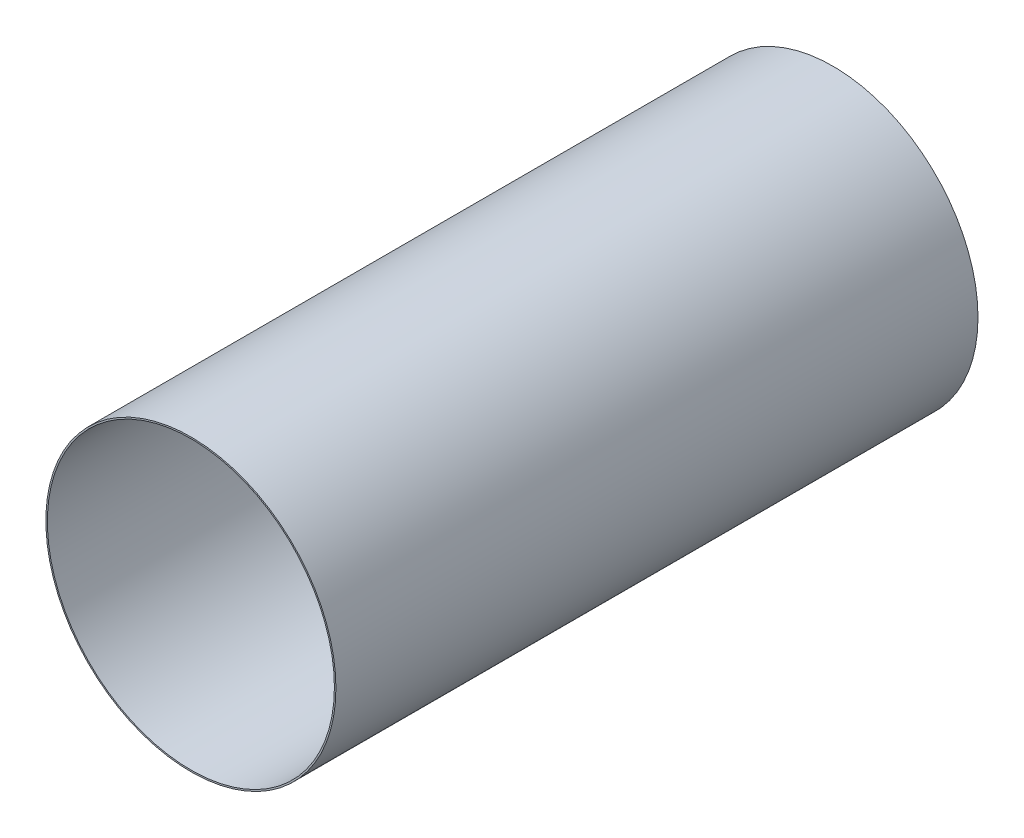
ISO-10303-21;
HEADER;
FILE_DESCRIPTION(('STEP AP214'),'2;1');
FILE_NAME('part.step','',(''),(''),'','','');
FILE_SCHEMA(('AUTOMOTIVE_DESIGN { 1 0 10303 214 1 1 1 1 }'));
ENDSEC;
DATA;
#1=APPLICATION_CONTEXT('core data for automotive mechanical design processes');
#2=APPLICATION_PROTOCOL_DEFINITION('international standard','automotive_design',2000,#1);
#3=PRODUCT_CONTEXT('',#1,'mechanical');
#4=PRODUCT('Part','Part','',(#3));
#5=PRODUCT_RELATED_PRODUCT_CATEGORY('part','',(#4));
#6=PRODUCT_DEFINITION_FORMATION('','',#4);
#7=PRODUCT_DEFINITION_CONTEXT('part definition',#1,'design');
#8=PRODUCT_DEFINITION('design','',#6,#7);
#9=PRODUCT_DEFINITION_SHAPE('','',#8);
#10=(LENGTH_UNIT() NAMED_UNIT(*) SI_UNIT(.MILLI.,.METRE.));
#11=(NAMED_UNIT(*) PLANE_ANGLE_UNIT() SI_UNIT($,.RADIAN.));
#12=(NAMED_UNIT(*) SI_UNIT($,.STERADIAN.) SOLID_ANGLE_UNIT());
#13=UNCERTAINTY_MEASURE_WITH_UNIT(LENGTH_MEASURE(1.E-05),#10,'distance_accuracy_value','');
#14=(GEOMETRIC_REPRESENTATION_CONTEXT(3) GLOBAL_UNCERTAINTY_ASSIGNED_CONTEXT((#13)) GLOBAL_UNIT_ASSIGNED_CONTEXT((#10,
#11,#12)) REPRESENTATION_CONTEXT('',''));
#15=CARTESIAN_POINT('',(0.,0.,0.));
#16=DIRECTION('',(0.,0.,1.));
#17=DIRECTION('',(1.,0.,0.));
#18=AXIS2_PLACEMENT_3D('',#15,#16,#17);
#19=CARTESIAN_POINT('',(0.,0.,-85.));
#20=DIRECTION('',(0.,0.,1.));
#21=DIRECTION('',(1.,0.,0.));
#22=AXIS2_PLACEMENT_3D('',#19,#20,#21);
#23=CYLINDRICAL_SURFACE('',#22,19.2);
#24=CARTESIAN_POINT('',(0.,0.,-85.));
#25=DIRECTION('',(0.,0.,1.));
#26=DIRECTION('',(1.,0.,0.));
#27=AXIS2_PLACEMENT_3D('',#24,#25,#26);
#28=CIRCLE('',#27,19.2);
#29=CARTESIAN_POINT('',(19.2,0.,-85.));
#30=VERTEX_POINT('',#29);
#31=EDGE_CURVE('E10',#30,#30,#28,.T.);
#32=ORIENTED_EDGE('',*,*,#31,.T.);
#33=EDGE_LOOP('',(#32));
#34=FACE_BOUND('',#33,.T.);
#35=CARTESIAN_POINT('',(0.,0.,0.));
#36=DIRECTION('',(0.,0.,1.));
#37=DIRECTION('',(1.,0.,0.));
#38=AXIS2_PLACEMENT_3D('',#35,#36,#37);
#39=CIRCLE('',#38,19.2);
#40=CARTESIAN_POINT('',(19.2,0.,0.));
#41=VERTEX_POINT('',#40);
#42=EDGE_CURVE('E40',#41,#41,#39,.T.);
#43=ORIENTED_EDGE('',*,*,#42,.F.);
#44=EDGE_LOOP('',(#43));
#45=FACE_BOUND('',#44,.T.);
#46=ADVANCED_FACE('F37',(#34,#45),#23,.T.);
#47=CARTESIAN_POINT('',(0.,0.,-85.));
#48=DIRECTION('',(0.,0.,1.));
#49=DIRECTION('',(1.,0.,0.));
#50=AXIS2_PLACEMENT_3D('',#47,#48,#49);
#51=PLANE('',#50);
#52=CARTESIAN_POINT('',(0.,0.,-85.));
#53=DIRECTION('',(0.,0.,1.));
#54=DIRECTION('',(1.,0.,0.));
#55=AXIS2_PLACEMENT_3D('',#52,#53,#54);
#56=CIRCLE('',#55,19.);
#57=CARTESIAN_POINT('',(19.,0.,-85.));
#58=VERTEX_POINT('',#57);
#59=EDGE_CURVE('E47',#58,#58,#56,.T.);
#60=ORIENTED_EDGE('',*,*,#59,.T.);
#61=EDGE_LOOP('',(#60));
#62=FACE_BOUND('',#61,.T.);
#63=ORIENTED_EDGE('',*,*,#31,.F.);
#64=EDGE_LOOP('',(#63));
#65=FACE_BOUND('',#64,.T.);
#66=ADVANCED_FACE('F55',(#62,#65),#51,.F.);
#67=CARTESIAN_POINT('',(0.,0.,0.));
#68=DIRECTION('',(0.,0.,1.));
#69=DIRECTION('',(1.,0.,0.));
#70=AXIS2_PLACEMENT_3D('',#67,#68,#69);
#71=PLANE('',#70);
#72=CARTESIAN_POINT('',(0.,0.,0.));
#73=DIRECTION('',(0.,0.,1.));
#74=DIRECTION('',(1.,0.,0.));
#75=AXIS2_PLACEMENT_3D('',#72,#73,#74);
#76=CIRCLE('',#75,19.);
#77=CARTESIAN_POINT('',(19.,0.,0.));
#78=VERTEX_POINT('',#77);
#79=EDGE_CURVE('E49',#78,#78,#76,.T.);
#80=ORIENTED_EDGE('',*,*,#79,.F.);
#81=EDGE_LOOP('',(#80));
#82=FACE_BOUND('',#81,.T.);
#83=ORIENTED_EDGE('',*,*,#42,.T.);
#84=EDGE_LOOP('',(#83));
#85=FACE_BOUND('',#84,.T.);
#86=ADVANCED_FACE('F61',(#82,#85),#71,.T.);
#87=CARTESIAN_POINT('',(0.,0.,-85.));
#88=DIRECTION('',(0.,0.,1.));
#89=DIRECTION('',(1.,0.,0.));
#90=AXIS2_PLACEMENT_3D('',#87,#88,#89);
#91=CYLINDRICAL_SURFACE('',#90,19.);
#92=ORIENTED_EDGE('',*,*,#59,.F.);
#93=EDGE_LOOP('',(#92));
#94=FACE_BOUND('',#93,.T.);
#95=ORIENTED_EDGE('',*,*,#79,.T.);
#96=EDGE_LOOP('',(#95));
#97=FACE_BOUND('',#96,.T.);
#98=ADVANCED_FACE('F58',(#94,#97),#91,.F.);
#99=CLOSED_SHELL('',(#46,#66,#86,#98));
#100=MANIFOLD_SOLID_BREP('B2',#99);
#101=ADVANCED_BREP_SHAPE_REPRESENTATION('',(#18,#100),#14);
#102=SHAPE_DEFINITION_REPRESENTATION(#9,#101);
ENDSEC;
END-ISO-10303-21;
